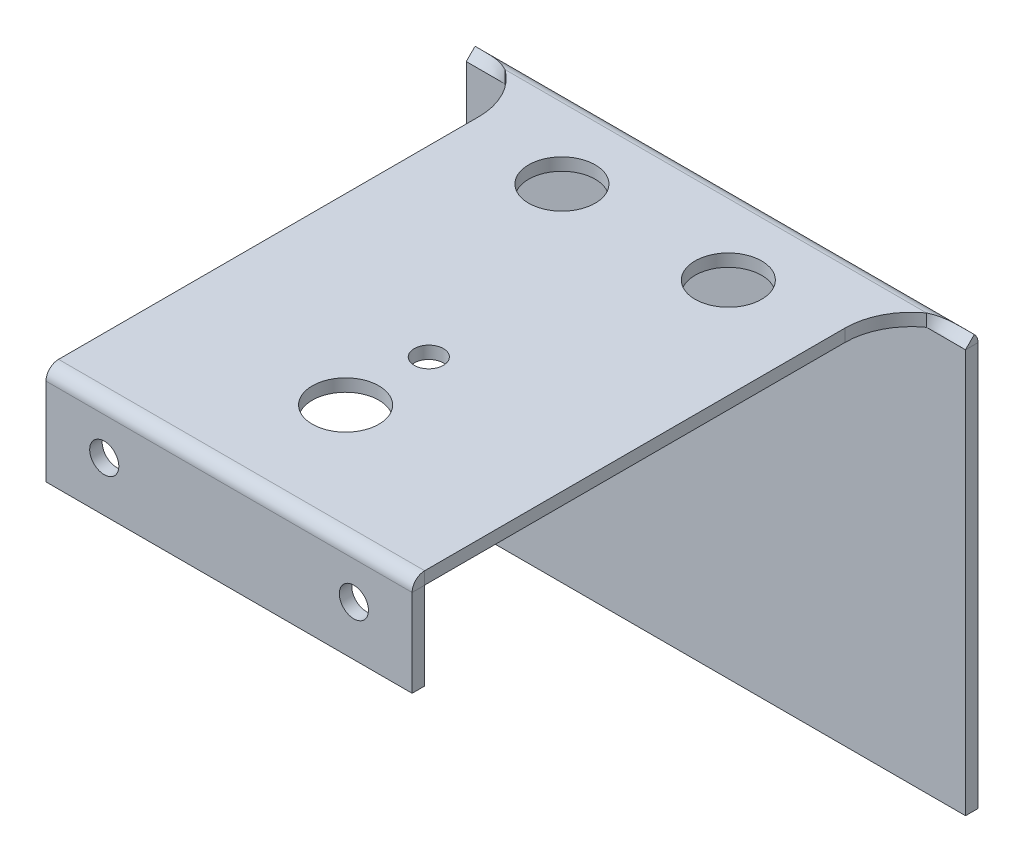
ISO-10303-21;
HEADER;
FILE_DESCRIPTION(('STEP AP214'),'2;1');
FILE_NAME('part.step','',(''),(''),'','','');
FILE_SCHEMA(('AUTOMOTIVE_DESIGN { 1 0 10303 214 1 1 1 1 }'));
ENDSEC;
DATA;
#1=APPLICATION_CONTEXT('core data for automotive mechanical design processes');
#2=APPLICATION_PROTOCOL_DEFINITION('international standard','automotive_design',2000,#1);
#3=PRODUCT_CONTEXT('',#1,'mechanical');
#4=PRODUCT('Part','Part','',(#3));
#5=PRODUCT_RELATED_PRODUCT_CATEGORY('part','',(#4));
#6=PRODUCT_DEFINITION_FORMATION('','',#4);
#7=PRODUCT_DEFINITION_CONTEXT('part definition',#1,'design');
#8=PRODUCT_DEFINITION('design','',#6,#7);
#9=PRODUCT_DEFINITION_SHAPE('','',#8);
#10=(LENGTH_UNIT() NAMED_UNIT(*) SI_UNIT(.MILLI.,.METRE.));
#11=(NAMED_UNIT(*) PLANE_ANGLE_UNIT() SI_UNIT($,.RADIAN.));
#12=(NAMED_UNIT(*) SI_UNIT($,.STERADIAN.) SOLID_ANGLE_UNIT());
#13=UNCERTAINTY_MEASURE_WITH_UNIT(LENGTH_MEASURE(1.E-05),#10,'distance_accuracy_value','');
#14=(GEOMETRIC_REPRESENTATION_CONTEXT(3) GLOBAL_UNCERTAINTY_ASSIGNED_CONTEXT((#13)) GLOBAL_UNIT_ASSIGNED_CONTEXT((#10,
#11,#12)) REPRESENTATION_CONTEXT('',''));
#15=CARTESIAN_POINT('',(0.,0.,0.));
#16=DIRECTION('',(0.,0.,1.));
#17=DIRECTION('',(1.,0.,0.));
#18=AXIS2_PLACEMENT_3D('',#15,#16,#17);
#19=CARTESIAN_POINT('',(30.,1.5,-64.));
#20=DIRECTION('',(0.,1.,0.));
#21=DIRECTION('',(0.,0.,1.));
#22=AXIS2_PLACEMENT_3D('',#19,#20,#21);
#23=PLANE('',#22);
#24=CARTESIAN_POINT('',(0.,1.5,-36.));
#25=DIRECTION('',(0.,1.,0.));
#26=DIRECTION('',(0.,0.,1.));
#27=AXIS2_PLACEMENT_3D('',#24,#25,#26);
#28=CIRCLE('',#27,1.75);
#29=CARTESIAN_POINT('',(0.,1.5,-34.25));
#30=VERTEX_POINT('',#29);
#31=EDGE_CURVE('E404',#30,#30,#28,.T.);
#32=ORIENTED_EDGE('',*,*,#31,.F.);
#33=EDGE_LOOP('',(#32));
#34=FACE_BOUND('',#33,.T.);
#35=CARTESIAN_POINT('',(-10.,1.5,-62.));
#36=DIRECTION('',(0.,1.,0.));
#37=DIRECTION('',(0.,0.,1.));
#38=AXIS2_PLACEMENT_3D('',#35,#36,#37);
#39=CIRCLE('',#38,4.);
#40=CARTESIAN_POINT('',(-10.,1.5,-58.));
#41=VERTEX_POINT('',#40);
#42=EDGE_CURVE('E416',#41,#41,#39,.T.);
#43=ORIENTED_EDGE('',*,*,#42,.F.);
#44=EDGE_LOOP('',(#43));
#45=FACE_BOUND('',#44,.T.);
#46=CARTESIAN_POINT('',(9.99999999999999,1.5,-62.));
#47=DIRECTION('',(0.,1.,0.));
#48=DIRECTION('',(0.,0.,1.));
#49=AXIS2_PLACEMENT_3D('',#46,#47,#48);
#50=CIRCLE('',#49,4.);
#51=CARTESIAN_POINT('',(9.99999999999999,1.5,-58.));
#52=VERTEX_POINT('',#51);
#53=EDGE_CURVE('E410',#52,#52,#50,.T.);
#54=ORIENTED_EDGE('',*,*,#53,.F.);
#55=EDGE_LOOP('',(#54));
#56=FACE_BOUND('',#55,.T.);
#57=CARTESIAN_POINT('',(0.,1.5,-26.));
#58=DIRECTION('',(0.,1.,0.));
#59=DIRECTION('',(0.,0.,1.));
#60=AXIS2_PLACEMENT_3D('',#57,#58,#59);
#61=CIRCLE('',#60,4.);
#62=CARTESIAN_POINT('',(0.,1.5,-22.));
#63=VERTEX_POINT('',#62);
#64=EDGE_CURVE('E397',#63,#63,#61,.T.);
#65=ORIENTED_EDGE('',*,*,#64,.F.);
#66=EDGE_LOOP('',(#65));
#67=FACE_BOUND('',#66,.T.);
#68=DIRECTION('',(0.,0.,1.));
#69=VECTOR('',#68,1.);
#70=CARTESIAN_POINT('',(-22.,1.5,0.));
#71=LINE('',#70,#69);
#72=CARTESIAN_POINT('',(-22.,1.5,-64.));
#73=VERTEX_POINT('',#72);
#74=CARTESIAN_POINT('',(-22.,1.5,-13.505));
#75=VERTEX_POINT('',#74);
#76=EDGE_CURVE('E58',#73,#75,#71,.T.);
#77=ORIENTED_EDGE('',*,*,#76,.T.);
#78=DIRECTION('',(1.,0.,0.));
#79=VECTOR('',#78,1.);
#80=CARTESIAN_POINT('',(30.,1.5,-13.505));
#81=LINE('',#80,#79);
#82=CARTESIAN_POINT('',(22.,1.49999999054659,-13.505));
#83=VERTEX_POINT('',#82);
#84=EDGE_CURVE('E499',#75,#83,#81,.T.);
#85=ORIENTED_EDGE('',*,*,#84,.T.);
#86=DIRECTION('',(0.,0.,-1.));
#87=VECTOR('',#86,1.);
#88=CARTESIAN_POINT('',(22.,1.5,0.));
#89=LINE('',#88,#87);
#90=CARTESIAN_POINT('',(22.,1.5,-64.));
#91=VERTEX_POINT('',#90);
#92=EDGE_CURVE('E424',#83,#91,#89,.T.);
#93=ORIENTED_EDGE('',*,*,#92,.T.);
#94=CARTESIAN_POINT('',(30.,1.5,-64.));
#95=DIRECTION('',(0.,-1.,0.));
#96=DIRECTION('',(0.,0.,1.));
#97=AXIS2_PLACEMENT_3D('',#94,#95,#96);
#98=CIRCLE('',#97,8.00000000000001);
#99=CARTESIAN_POINT('',(25.3293496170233,1.5,-70.495));
#100=VERTEX_POINT('',#99);
#101=EDGE_CURVE('E429',#91,#100,#98,.T.);
#102=ORIENTED_EDGE('',*,*,#101,.T.);
#103=DIRECTION('',(-1.,0.,0.));
#104=VECTOR('',#103,1.);
#105=CARTESIAN_POINT('',(30.,1.5,-70.495));
#106=LINE('',#105,#104);
#107=CARTESIAN_POINT('',(-25.3293496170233,1.50000004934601,-70.495));
#108=VERTEX_POINT('',#107);
#109=EDGE_CURVE('E426',#100,#108,#106,.T.);
#110=ORIENTED_EDGE('',*,*,#109,.T.);
#111=CARTESIAN_POINT('',(-30.,1.5,-64.));
#112=DIRECTION('',(0.,-1.,0.));
#113=DIRECTION('',(0.,0.,1.));
#114=AXIS2_PLACEMENT_3D('',#111,#112,#113);
#115=CIRCLE('',#114,8.);
#116=EDGE_CURVE('E427',#108,#73,#115,.T.);
#117=ORIENTED_EDGE('',*,*,#116,.T.);
#118=EDGE_LOOP('',(#77,#85,#93,#102,#110,#117));
#119=FACE_BOUND('',#118,.T.);
#120=ADVANCED_FACE('F54',(#34,#45,#56,#67,#119),#23,.T.);
#121=CARTESIAN_POINT('',(30.,0.,-64.));
#122=DIRECTION('',(0.,1.,0.));
#123=DIRECTION('',(0.,0.,1.));
#124=AXIS2_PLACEMENT_3D('',#121,#122,#123);
#125=PLANE('',#124);
#126=DIRECTION('',(1.,0.,0.));
#127=VECTOR('',#126,1.);
#128=CARTESIAN_POINT('',(30.,0.,-13.505));
#129=LINE('',#128,#127);
#130=CARTESIAN_POINT('',(-22.,0.,-13.505));
#131=VERTEX_POINT('',#130);
#132=CARTESIAN_POINT('',(22.,0.,-13.505));
#133=VERTEX_POINT('',#132);
#134=EDGE_CURVE('E63',#131,#133,#129,.T.);
#135=ORIENTED_EDGE('',*,*,#134,.F.);
#136=DIRECTION('',(0.,0.,1.));
#137=VECTOR('',#136,1.);
#138=CARTESIAN_POINT('',(-22.,0.,0.));
#139=LINE('',#138,#137);
#140=CARTESIAN_POINT('',(-22.,0.,-64.));
#141=VERTEX_POINT('',#140);
#142=EDGE_CURVE('E79',#141,#131,#139,.T.);
#143=ORIENTED_EDGE('',*,*,#142,.F.);
#144=CARTESIAN_POINT('',(-30.,0.,-64.));
#145=DIRECTION('',(0.,-1.,0.));
#146=DIRECTION('',(0.,0.,1.));
#147=AXIS2_PLACEMENT_3D('',#144,#145,#146);
#148=CIRCLE('',#147,8.);
#149=CARTESIAN_POINT('',(-25.3293496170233,0.,-70.495));
#150=VERTEX_POINT('',#149);
#151=EDGE_CURVE('E533',#150,#141,#148,.T.);
#152=ORIENTED_EDGE('',*,*,#151,.F.);
#153=DIRECTION('',(-1.,0.,0.));
#154=VECTOR('',#153,1.);
#155=CARTESIAN_POINT('',(30.,0.,-70.495));
#156=LINE('',#155,#154);
#157=CARTESIAN_POINT('',(25.3293496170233,0.,-70.495));
#158=VERTEX_POINT('',#157);
#159=EDGE_CURVE('E445',#158,#150,#156,.T.);
#160=ORIENTED_EDGE('',*,*,#159,.F.);
#161=CARTESIAN_POINT('',(30.,0.,-64.));
#162=DIRECTION('',(0.,-1.,0.));
#163=DIRECTION('',(0.,0.,1.));
#164=AXIS2_PLACEMENT_3D('',#161,#162,#163);
#165=CIRCLE('',#164,8.00000000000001);
#166=CARTESIAN_POINT('',(22.,0.,-64.));
#167=VERTEX_POINT('',#166);
#168=EDGE_CURVE('E419',#167,#158,#165,.T.);
#169=ORIENTED_EDGE('',*,*,#168,.F.);
#170=DIRECTION('',(0.,0.,-1.));
#171=VECTOR('',#170,1.);
#172=CARTESIAN_POINT('',(22.,0.,0.));
#173=LINE('',#172,#171);
#174=EDGE_CURVE('E71',#133,#167,#173,.T.);
#175=ORIENTED_EDGE('',*,*,#174,.F.);
#176=EDGE_LOOP('',(#135,#143,#152,#160,#169,#175));
#177=FACE_BOUND('',#176,.T.);
#178=CARTESIAN_POINT('',(0.,0.,-36.));
#179=DIRECTION('',(0.,1.,0.));
#180=DIRECTION('',(0.,0.,1.));
#181=AXIS2_PLACEMENT_3D('',#178,#179,#180);
#182=CIRCLE('',#181,1.75);
#183=CARTESIAN_POINT('',(0.,0.,-34.25));
#184=VERTEX_POINT('',#183);
#185=EDGE_CURVE('E401',#184,#184,#182,.T.);
#186=ORIENTED_EDGE('',*,*,#185,.T.);
#187=EDGE_LOOP('',(#186));
#188=FACE_BOUND('',#187,.T.);
#189=CARTESIAN_POINT('',(-10.,0.,-62.));
#190=DIRECTION('',(0.,1.,0.));
#191=DIRECTION('',(0.,0.,1.));
#192=AXIS2_PLACEMENT_3D('',#189,#190,#191);
#193=CIRCLE('',#192,4.);
#194=CARTESIAN_POINT('',(-10.,0.,-58.));
#195=VERTEX_POINT('',#194);
#196=EDGE_CURVE('E413',#195,#195,#193,.T.);
#197=ORIENTED_EDGE('',*,*,#196,.T.);
#198=EDGE_LOOP('',(#197));
#199=FACE_BOUND('',#198,.T.);
#200=CARTESIAN_POINT('',(9.99999999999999,0.,-62.));
#201=DIRECTION('',(0.,1.,0.));
#202=DIRECTION('',(0.,0.,1.));
#203=AXIS2_PLACEMENT_3D('',#200,#201,#202);
#204=CIRCLE('',#203,4.);
#205=CARTESIAN_POINT('',(9.99999999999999,0.,-58.));
#206=VERTEX_POINT('',#205);
#207=EDGE_CURVE('E407',#206,#206,#204,.T.);
#208=ORIENTED_EDGE('',*,*,#207,.T.);
#209=EDGE_LOOP('',(#208));
#210=FACE_BOUND('',#209,.T.);
#211=CARTESIAN_POINT('',(0.,0.,-26.));
#212=DIRECTION('',(0.,1.,0.));
#213=DIRECTION('',(0.,0.,1.));
#214=AXIS2_PLACEMENT_3D('',#211,#212,#213);
#215=CIRCLE('',#214,4.);
#216=CARTESIAN_POINT('',(0.,0.,-22.));
#217=VERTEX_POINT('',#216);
#218=EDGE_CURVE('E389',#217,#217,#215,.T.);
#219=ORIENTED_EDGE('',*,*,#218,.T.);
#220=EDGE_LOOP('',(#219));
#221=FACE_BOUND('',#220,.T.);
#222=ADVANCED_FACE('F463',(#177,#188,#199,#210,#221),#125,.F.);
#223=CARTESIAN_POINT('',(30.,1.5,-64.));
#224=DIRECTION('',(0.,-1.,0.));
#225=DIRECTION('',(0.,0.,-1.));
#226=AXIS2_PLACEMENT_3D('',#223,#224,#225);
#227=CYLINDRICAL_SURFACE('',#226,8.00000000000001);
#228=CARTESIAN_POINT('',(25.3293496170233,1.50000004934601,-70.495));
#229=CARTESIAN_POINT('',(25.3293496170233,4.93460099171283E-08,-70.495));
#230=B_SPLINE_CURVE_WITH_KNOTS('',1,(#228,#229),.UNSPECIFIED.,.F.,.F.,(2,2),(0.,1.),.UNSPECIFIED.);
#231=EDGE_CURVE('E434',#100,#158,#230,.T.);
#232=ORIENTED_EDGE('',*,*,#231,.F.);
#233=ORIENTED_EDGE('',*,*,#101,.F.);
#234=DIRECTION('',(0.,-1.,0.));
#235=VECTOR('',#234,1.);
#236=CARTESIAN_POINT('',(22.,1.5,-64.));
#237=LINE('',#236,#235);
#238=EDGE_CURVE('E420',#91,#167,#237,.T.);
#239=ORIENTED_EDGE('',*,*,#238,.T.);
#240=ORIENTED_EDGE('',*,*,#168,.T.);
#241=EDGE_LOOP('',(#232,#233,#239,#240));
#242=FACE_BOUND('',#241,.T.);
#243=ADVANCED_FACE('F458',(#242),#227,.F.);
#244=CARTESIAN_POINT('',(-30.,1.5,-64.));
#245=DIRECTION('',(0.,-1.,0.));
#246=DIRECTION('',(0.,0.,-1.));
#247=AXIS2_PLACEMENT_3D('',#244,#245,#246);
#248=CYLINDRICAL_SURFACE('',#247,8.);
#249=CARTESIAN_POINT('',(-25.3293496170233,4.93460099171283E-08,-70.495));
#250=CARTESIAN_POINT('',(-25.3293496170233,1.50000004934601,-70.495));
#251=B_SPLINE_CURVE_WITH_KNOTS('',1,(#249,#250),.UNSPECIFIED.,.F.,.F.,(2,2),(0.,1.),.UNSPECIFIED.);
#252=EDGE_CURVE('E440',#150,#108,#251,.T.);
#253=ORIENTED_EDGE('',*,*,#252,.F.);
#254=ORIENTED_EDGE('',*,*,#151,.T.);
#255=DIRECTION('',(0.,-1.,0.));
#256=VECTOR('',#255,1.);
#257=CARTESIAN_POINT('',(-22.,1.5,-64.));
#258=LINE('',#257,#256);
#259=EDGE_CURVE('E423',#73,#141,#258,.T.);
#260=ORIENTED_EDGE('',*,*,#259,.F.);
#261=ORIENTED_EDGE('',*,*,#116,.F.);
#262=EDGE_LOOP('',(#253,#254,#260,#261));
#263=FACE_BOUND('',#262,.T.);
#264=ADVANCED_FACE('F447',(#263),#248,.F.);
#265=CARTESIAN_POINT('',(-22.,1.5,0.));
#266=DIRECTION('',(1.,0.,0.));
#267=DIRECTION('',(0.,0.,-1.));
#268=AXIS2_PLACEMENT_3D('',#265,#266,#267);
#269=PLANE('',#268);
#270=DIRECTION('',(0.,-1.,0.));
#271=VECTOR('',#270,1.);
#272=CARTESIAN_POINT('',(-22.,1.5,-13.505));
#273=LINE('',#272,#271);
#274=EDGE_CURVE('E501',#75,#131,#273,.T.);
#275=ORIENTED_EDGE('',*,*,#274,.F.);
#276=ORIENTED_EDGE('',*,*,#76,.F.);
#277=ORIENTED_EDGE('',*,*,#259,.T.);
#278=ORIENTED_EDGE('',*,*,#142,.T.);
#279=EDGE_LOOP('',(#275,#276,#277,#278));
#280=FACE_BOUND('',#279,.T.);
#281=ADVANCED_FACE('F457',(#280),#269,.F.);
#282=CARTESIAN_POINT('',(22.,1.5,0.));
#283=DIRECTION('',(-1.,0.,0.));
#284=DIRECTION('',(0.,0.,1.));
#285=AXIS2_PLACEMENT_3D('',#282,#283,#284);
#286=PLANE('',#285);
#287=DIRECTION('',(0.,1.,0.));
#288=VECTOR('',#287,1.);
#289=CARTESIAN_POINT('',(22.,1.5,-13.505));
#290=LINE('',#289,#288);
#291=EDGE_CURVE('E12',#133,#83,#290,.T.);
#292=ORIENTED_EDGE('',*,*,#291,.F.);
#293=ORIENTED_EDGE('',*,*,#174,.T.);
#294=ORIENTED_EDGE('',*,*,#238,.F.);
#295=ORIENTED_EDGE('',*,*,#92,.F.);
#296=EDGE_LOOP('',(#292,#293,#294,#295));
#297=FACE_BOUND('',#296,.T.);
#298=ADVANCED_FACE('F56',(#297),#286,.F.);
#299=CARTESIAN_POINT('',(-10.,1.5,-62.));
#300=DIRECTION('',(0.,-1.,0.));
#301=DIRECTION('',(0.,0.,-1.));
#302=AXIS2_PLACEMENT_3D('',#299,#300,#301);
#303=CYLINDRICAL_SURFACE('',#302,4.);
#304=ORIENTED_EDGE('',*,*,#42,.T.);
#305=EDGE_LOOP('',(#304));
#306=FACE_BOUND('',#305,.T.);
#307=ORIENTED_EDGE('',*,*,#196,.F.);
#308=EDGE_LOOP('',(#307));
#309=FACE_BOUND('',#308,.T.);
#310=ADVANCED_FACE('F842',(#306,#309),#303,.F.);
#311=CARTESIAN_POINT('',(9.99999999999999,1.5,-62.));
#312=DIRECTION('',(0.,-1.,0.));
#313=DIRECTION('',(0.,0.,-1.));
#314=AXIS2_PLACEMENT_3D('',#311,#312,#313);
#315=CYLINDRICAL_SURFACE('',#314,4.);
#316=ORIENTED_EDGE('',*,*,#53,.T.);
#317=EDGE_LOOP('',(#316));
#318=FACE_BOUND('',#317,.T.);
#319=ORIENTED_EDGE('',*,*,#207,.F.);
#320=EDGE_LOOP('',(#319));
#321=FACE_BOUND('',#320,.T.);
#322=ADVANCED_FACE('F491',(#318,#321),#315,.F.);
#323=CARTESIAN_POINT('',(0.,1.5,-36.));
#324=DIRECTION('',(0.,-1.,0.));
#325=DIRECTION('',(0.,0.,-1.));
#326=AXIS2_PLACEMENT_3D('',#323,#324,#325);
#327=CYLINDRICAL_SURFACE('',#326,1.75);
#328=ORIENTED_EDGE('',*,*,#31,.T.);
#329=EDGE_LOOP('',(#328));
#330=FACE_BOUND('',#329,.T.);
#331=ORIENTED_EDGE('',*,*,#185,.F.);
#332=EDGE_LOOP('',(#331));
#333=FACE_BOUND('',#332,.T.);
#334=ADVANCED_FACE('F483',(#330,#333),#327,.F.);
#335=CARTESIAN_POINT('',(0.,1.5,-26.));
#336=DIRECTION('',(0.,-1.,0.));
#337=DIRECTION('',(0.,0.,-1.));
#338=AXIS2_PLACEMENT_3D('',#335,#336,#337);
#339=CYLINDRICAL_SURFACE('',#338,4.);
#340=ORIENTED_EDGE('',*,*,#64,.T.);
#341=EDGE_LOOP('',(#340));
#342=FACE_BOUND('',#341,.T.);
#343=ORIENTED_EDGE('',*,*,#218,.F.);
#344=EDGE_LOOP('',(#343));
#345=FACE_BOUND('',#344,.T.);
#346=ADVANCED_FACE('F349',(#342,#345),#339,.F.);
#347=CARTESIAN_POINT('',(25.3293496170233,1.50000004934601,-70.495));
#348=CARTESIAN_POINT('',(25.8063753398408,1.50000004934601,-70.7248903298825));
#349=CARTESIAN_POINT('',(26.2324936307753,1.44912501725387,-70.9113821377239));
#350=CARTESIAN_POINT('',(26.7970237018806,1.36671215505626,-71.1197749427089));
#351=CARTESIAN_POINT('',(26.9726639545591,1.33790001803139,-71.1778244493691));
#352=CARTESIAN_POINT('',(27.2173196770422,1.29825619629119,-71.2495275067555));
#353=CARTESIAN_POINT('',(27.295737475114,1.2856143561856,-71.2708740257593));
#354=CARTESIAN_POINT('',(27.4086630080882,1.26801372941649,-71.2993042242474));
#355=CARTESIAN_POINT('',(27.4455213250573,1.26237258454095,-71.3081826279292));
#356=CARTESIAN_POINT('',(27.4996335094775,1.25430114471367,-71.320631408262));
#357=CARTESIAN_POINT('',(27.5174750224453,1.25167563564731,-71.324636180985));
#358=CARTESIAN_POINT('',(27.5439434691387,1.24784062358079,-71.3304295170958));
#359=CARTESIAN_POINT('',(27.5527173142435,1.24657949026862,-71.3323249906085));
#360=CARTESIAN_POINT('',(27.5701670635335,1.24409254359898,-71.3360452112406));
#361=CARTESIAN_POINT('',(27.5779055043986,1.24299796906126,-71.3376754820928));
#362=CARTESIAN_POINT('',(28.1995913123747,1.15596595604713,-71.4666438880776));
#363=CARTESIAN_POINT('',(29.0037871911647,1.08590796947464,-71.5345545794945));
#364=CARTESIAN_POINT('',(30.,1.05773127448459,-71.5627312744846));
#365=CARTESIAN_POINT('',(25.3293496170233,4.93460099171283E-08,-70.495));
#366=CARTESIAN_POINT('',(25.8059945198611,4.93460099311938E-08,-70.4965212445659));
#367=CARTESIAN_POINT('',(26.2324936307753,-0.000336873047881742,-70.4977575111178));
#368=CARTESIAN_POINT('',(26.7970237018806,-0.000882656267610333,-70.4991376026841));
#369=CARTESIAN_POINT('',(26.9726639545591,-0.00107346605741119,-70.4995220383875));
#370=CARTESIAN_POINT('',(27.2173196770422,-0.00133600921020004,-70.4999968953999));
#371=CARTESIAN_POINT('',(27.295737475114,-0.00141973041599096,-70.5001382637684));
#372=CARTESIAN_POINT('',(27.4086630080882,-0.0015362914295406,-70.5003265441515));
#373=CARTESIAN_POINT('',(27.4455213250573,-0.00157365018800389,-70.5003853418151));
#374=CARTESIAN_POINT('',(27.4996335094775,-0.00162710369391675,-70.5004677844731));
#375=CARTESIAN_POINT('',(27.5174750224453,-0.00164449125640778,-70.5004943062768));
#376=CARTESIAN_POINT('',(27.5439434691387,-0.00166988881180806,-70.5005326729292));
#377=CARTESIAN_POINT('',(27.5527173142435,-0.00167824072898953,-70.5005452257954));
#378=CARTESIAN_POINT('',(27.5701670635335,-0.00169471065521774,-70.5005698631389));
#379=CARTESIAN_POINT('',(27.5779055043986,-0.00170195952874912,-70.5005806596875));
#380=CARTESIAN_POINT('',(28.1995913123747,-0.00227833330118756,-70.5014347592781));
#381=CARTESIAN_POINT('',(29.0037680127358,-0.00274229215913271,-70.5018844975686));
#382=CARTESIAN_POINT('',(30.,-0.00292889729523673,-70.5020711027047));
#383=B_SPLINE_SURFACE_WITH_KNOTS('',1,3,((#347,#348,#349,#350,#351,#352,#353,#354,#355,#356,
#357,#358,#359,#360,#361,#362,#363,#364),(#365,#366,#367,#368,#369,#370,#371,#372,#373,#374,
#375,#376,#377,#378,#379,#380,#381,#382)),.UNSPECIFIED.,.F.,.F.,.F.,(2,2),(4,2,2,2,2,2,2,2,4),
(0.,1.),(0.,0.25,0.375,0.4375,0.46875,0.484375,0.4921875,0.5,1.),.UNSPECIFIED.);
#384=CARTESIAN_POINT('',(25.3293496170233,4.93460099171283E-08,-70.495));
#385=CARTESIAN_POINT('',(25.8059945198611,4.93460099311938E-08,-70.4965212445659));
#386=CARTESIAN_POINT('',(26.2324936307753,-0.000336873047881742,-70.4977575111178));
#387=CARTESIAN_POINT('',(26.7970237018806,-0.000882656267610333,-70.4991376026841));
#388=CARTESIAN_POINT('',(26.9726639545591,-0.00107346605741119,-70.4995220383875));
#389=CARTESIAN_POINT('',(27.2173196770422,-0.00133600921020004,-70.4999968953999));
#390=CARTESIAN_POINT('',(27.295737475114,-0.00141973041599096,-70.5001382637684));
#391=CARTESIAN_POINT('',(27.4086630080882,-0.0015362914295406,-70.5003265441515));
#392=CARTESIAN_POINT('',(27.4455213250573,-0.00157365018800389,-70.5003853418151));
#393=CARTESIAN_POINT('',(27.4996335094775,-0.00162710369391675,-70.5004677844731));
#394=CARTESIAN_POINT('',(27.5174750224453,-0.00164449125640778,-70.5004943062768));
#395=CARTESIAN_POINT('',(27.5439434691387,-0.00166988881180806,-70.5005326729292));
#396=CARTESIAN_POINT('',(27.5527173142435,-0.00167824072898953,-70.5005452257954));
#397=CARTESIAN_POINT('',(27.5701670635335,-0.00169471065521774,-70.5005698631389));
#398=CARTESIAN_POINT('',(27.5779055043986,-0.00170195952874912,-70.5005806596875));
#399=CARTESIAN_POINT('',(28.1995913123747,-0.00227833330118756,-70.5014347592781));
#400=CARTESIAN_POINT('',(29.0037680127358,-0.00274229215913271,-70.5018844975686));
#401=CARTESIAN_POINT('',(30.,-0.00292889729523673,-70.5020711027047));
#402=B_SPLINE_CURVE_WITH_KNOTS('',3,(#384,#385,#386,#387,#388,#389,#390,#391,#392,#393,#394,
#395,#396,#397,#398,#399,#400,#401),.UNSPECIFIED.,.F.,.F.,(4,2,2,2,2,2,2,2,4),(0.,0.25,0.375,
0.4375,0.46875,0.484375,0.4921875,0.5,1.),.UNSPECIFIED.);
#403=CARTESIAN_POINT('',(30.,-0.00292889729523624,-70.5020711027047));
#404=VERTEX_POINT('',#403);
#405=EDGE_CURVE('E225',#158,#404,#402,.T.);
#406=CARTESIAN_POINT('',(30.,-0.00292889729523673,-70.5020711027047));
#407=CARTESIAN_POINT('',(30.,1.05773127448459,-71.5627312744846));
#408=B_SPLINE_CURVE_WITH_KNOTS('',1,(#406,#407),.UNSPECIFIED.,.F.,.F.,(2,2),(0.,1.),.UNSPECIFIED.);
#409=CARTESIAN_POINT('',(30.,1.05773127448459,-71.5627312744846));
#410=VERTEX_POINT('',#409);
#411=EDGE_CURVE('E398',#404,#410,#408,.T.);
#412=CARTESIAN_POINT('',(30.,1.05773127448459,-71.5627312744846));
#413=CARTESIAN_POINT('',(29.0037871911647,1.08590796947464,-71.5345545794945));
#414=CARTESIAN_POINT('',(28.1995913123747,1.15596595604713,-71.4666438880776));
#415=CARTESIAN_POINT('',(27.5779055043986,1.24299796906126,-71.3376754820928));
#416=CARTESIAN_POINT('',(27.5701670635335,1.24409254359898,-71.3360452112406));
#417=CARTESIAN_POINT('',(27.5527173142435,1.24657949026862,-71.3323249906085));
#418=CARTESIAN_POINT('',(27.5439434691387,1.24784062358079,-71.3304295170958));
#419=CARTESIAN_POINT('',(27.5174750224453,1.25167563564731,-71.324636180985));
#420=CARTESIAN_POINT('',(27.4996335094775,1.25430114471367,-71.320631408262));
#421=CARTESIAN_POINT('',(27.4455213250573,1.26237258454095,-71.3081826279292));
#422=CARTESIAN_POINT('',(27.4086630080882,1.26801372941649,-71.2993042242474));
#423=CARTESIAN_POINT('',(27.295737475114,1.2856143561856,-71.2708740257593));
#424=CARTESIAN_POINT('',(27.2173196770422,1.29825619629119,-71.2495275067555));
#425=CARTESIAN_POINT('',(26.9726639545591,1.33790001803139,-71.1778244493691));
#426=CARTESIAN_POINT('',(26.7970237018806,1.36671215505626,-71.1197749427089));
#427=CARTESIAN_POINT('',(26.2324936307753,1.44912501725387,-70.9113821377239));
#428=CARTESIAN_POINT('',(25.8063753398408,1.50000004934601,-70.7248903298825));
#429=CARTESIAN_POINT('',(25.3293496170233,1.50000004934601,-70.495));
#430=B_SPLINE_CURVE_WITH_KNOTS('',3,(#412,#413,#414,#415,#416,#417,#418,#419,#420,#421,#422,
#423,#424,#425,#426,#427,#428,#429),.UNSPECIFIED.,.F.,.F.,(4,2,2,2,2,2,2,2,4),(0.,0.5,0.5078125,
0.515625,0.53125,0.5625,0.625,0.75,1.),.UNSPECIFIED.);
#431=EDGE_CURVE('E562',#100,#410,#430,.F.);
#432=ORIENTED_EDGE('',*,*,#231,.T.);
#433=ORIENTED_EDGE('',*,*,#405,.T.);
#434=ORIENTED_EDGE('',*,*,#411,.T.);
#435=ORIENTED_EDGE('',*,*,#431,.F.);
#436=EDGE_LOOP('',(#432,#433,#434,#435));
#437=FACE_BOUND('',#436,.T.);
#438=ADVANCED_FACE('F345',(#437),#383,.T.);
#439=CARTESIAN_POINT('',(30.,-0.0100000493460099,-70.495));
#440=DIRECTION('',(1.,0.,0.));
#441=DIRECTION('',(0.,0.,-1.));
#442=AXIS2_PLACEMENT_3D('',#439,#440,#441);
#443=PLANE('',#442);
#444=ORIENTED_EDGE('',*,*,#411,.F.);
#445=CARTESIAN_POINT('',(30.,-0.01,-70.495));
#446=DIRECTION('',(-1.,0.,0.));
#447=DIRECTION('',(0.,0.,1.));
#448=AXIS2_PLACEMENT_3D('',#445,#446,#447);
#449=CIRCLE('',#448,0.0100000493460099);
#450=CARTESIAN_POINT('',(30.,-0.01000000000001,-70.505));
#451=VERTEX_POINT('',#450);
#452=EDGE_CURVE('E252',#404,#451,#449,.T.);
#453=ORIENTED_EDGE('',*,*,#452,.T.);
#454=DIRECTION('',(0.,0.,1.));
#455=VECTOR('',#454,1.);
#456=CARTESIAN_POINT('',(30.,-0.01000000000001,-72.005));
#457=LINE('',#456,#455);
#458=CARTESIAN_POINT('',(30.,-0.01000000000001,-72.005));
#459=VERTEX_POINT('',#458);
#460=EDGE_CURVE('E235',#459,#451,#457,.T.);
#461=ORIENTED_EDGE('',*,*,#460,.F.);
#462=CARTESIAN_POINT('',(30.,-0.0100000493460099,-70.495));
#463=DIRECTION('',(-1.,0.,0.));
#464=DIRECTION('',(0.,0.,1.));
#465=AXIS2_PLACEMENT_3D('',#462,#463,#464);
#466=CIRCLE('',#465,1.51000006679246);
#467=EDGE_CURVE('E262',#410,#459,#466,.T.);
#468=ORIENTED_EDGE('',*,*,#467,.F.);
#469=EDGE_LOOP('',(#444,#453,#461,#468));
#470=FACE_BOUND('',#469,.T.);
#471=ADVANCED_FACE('F489',(#470),#443,.T.);
#472=CARTESIAN_POINT('',(-30.,-0.0100000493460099,-70.495));
#473=DIRECTION('',(-1.,0.,0.));
#474=DIRECTION('',(0.,0.,1.));
#475=AXIS2_PLACEMENT_3D('',#472,#473,#474);
#476=PLANE('',#475);
#477=DIRECTION('',(0.,0.,-1.));
#478=VECTOR('',#477,1.);
#479=CARTESIAN_POINT('',(-30.,-0.01000000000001,-72.005));
#480=LINE('',#479,#478);
#481=CARTESIAN_POINT('',(-30.,-0.01000000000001,-70.505));
#482=VERTEX_POINT('',#481);
#483=CARTESIAN_POINT('',(-30.,-0.010000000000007,-72.005000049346));
#484=VERTEX_POINT('',#483);
#485=EDGE_CURVE('E226',#482,#484,#480,.T.);
#486=ORIENTED_EDGE('',*,*,#485,.F.);
#487=CARTESIAN_POINT('',(-30.,-0.01,-70.495));
#488=DIRECTION('',(-1.,0.,0.));
#489=DIRECTION('',(0.,0.,1.));
#490=AXIS2_PLACEMENT_3D('',#487,#488,#489);
#491=CIRCLE('',#490,0.0100000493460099);
#492=CARTESIAN_POINT('',(-30.,-0.0029288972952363,-70.5020711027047));
#493=VERTEX_POINT('',#492);
#494=EDGE_CURVE('E255',#482,#493,#491,.F.);
#495=ORIENTED_EDGE('',*,*,#494,.T.);
#496=CARTESIAN_POINT('',(-30.,1.05773127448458,-71.5627312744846));
#497=CARTESIAN_POINT('',(-30.,-0.00292889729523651,-70.5020711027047));
#498=B_SPLINE_CURVE_WITH_KNOTS('',1,(#496,#497),.UNSPECIFIED.,.F.,.F.,(2,2),(0.,1.),.UNSPECIFIED.);
#499=CARTESIAN_POINT('',(-30.,1.05773126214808,-71.5627312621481));
#500=VERTEX_POINT('',#499);
#501=EDGE_CURVE('E377',#493,#500,#498,.F.);
#502=ORIENTED_EDGE('',*,*,#501,.T.);
#503=CARTESIAN_POINT('',(-30.,-0.0100000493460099,-70.495));
#504=DIRECTION('',(1.,0.,0.));
#505=DIRECTION('',(0.,0.,-1.));
#506=AXIS2_PLACEMENT_3D('',#503,#504,#505);
#507=CIRCLE('',#506,1.51000006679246);
#508=EDGE_CURVE('E304',#484,#500,#507,.T.);
#509=ORIENTED_EDGE('',*,*,#508,.F.);
#510=EDGE_LOOP('',(#486,#495,#502,#509));
#511=FACE_BOUND('',#510,.T.);
#512=ADVANCED_FACE('F278',(#511),#476,.T.);
#513=CARTESIAN_POINT('',(-30.,1.05773127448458,-71.5627312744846));
#514=CARTESIAN_POINT('',(-29.4814024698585,1.07597145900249,-71.5444910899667));
#515=CARTESIAN_POINT('',(-29.0210072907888,1.10181593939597,-71.5178879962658));
#516=CARTESIAN_POINT('',(-28.4177209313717,1.14915408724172,-71.4630111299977));
#517=CARTESIAN_POINT('',(-28.2311763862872,1.16634160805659,-71.4422105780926));
#518=CARTESIAN_POINT('',(-27.9731859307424,1.19367270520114,-71.4068629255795));
#519=CARTESIAN_POINT('',(-27.8908268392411,1.20303979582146,-71.3943888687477));
#520=CARTESIAN_POINT('',(-27.7727447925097,1.21739023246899,-71.3745907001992));
#521=CARTESIAN_POINT('',(-27.7342935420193,1.22222356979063,-71.367810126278));
#522=CARTESIAN_POINT('',(-27.6779808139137,1.22953670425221,-71.3573612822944));
#523=CARTESIAN_POINT('',(-27.6594372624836,1.23198493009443,-71.3538320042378));
#524=CARTESIAN_POINT('',(-27.6228048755,1.23690038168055,-71.3466797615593));
#525=CARTESIAN_POINT('',(-27.6061303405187,1.23917157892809,-71.3433474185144));
#526=CARTESIAN_POINT('',(-27.2784421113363,1.28459066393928,-71.276011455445));
#527=CARTESIAN_POINT('',(-26.9361104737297,1.34440936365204,-71.1790897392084));
#528=CARTESIAN_POINT('',(-26.1836088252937,1.45217488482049,-70.9005220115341));
#529=CARTESIAN_POINT('',(-25.7737820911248,1.50000004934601,-70.7174135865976));
#530=CARTESIAN_POINT('',(-25.3293496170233,1.50000004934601,-70.495));
#531=CARTESIAN_POINT('',(-30.,-0.00292889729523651,-70.5020711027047));
#532=CARTESIAN_POINT('',(-29.4814018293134,-0.00280810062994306,-70.5019503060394));
#533=CARTESIAN_POINT('',(-29.0210072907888,-0.0026369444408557,-70.5017741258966));
#534=CARTESIAN_POINT('',(-28.4177209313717,-0.00232344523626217,-70.5014107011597));
#535=CARTESIAN_POINT('',(-28.2311763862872,-0.00220962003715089,-70.501272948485));
#536=CARTESIAN_POINT('',(-27.9731859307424,-0.00202861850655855,-70.5010388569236));
#537=CARTESIAN_POINT('',(-27.8908268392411,-0.00196658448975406,-70.5009562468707));
#538=CARTESIAN_POINT('',(-27.7727447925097,-0.00187154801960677,-70.500825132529));
#539=CARTESIAN_POINT('',(-27.7342935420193,-0.0018395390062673,-70.5007802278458));
#540=CARTESIAN_POINT('',(-27.6779808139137,-0.00179110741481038,-70.5007110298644));
#541=CARTESIAN_POINT('',(-27.6594372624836,-0.00177489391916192,-70.5006876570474));
#542=CARTESIAN_POINT('',(-27.6228048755,-0.00174234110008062,-70.5006402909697));
#543=CARTESIAN_POINT('',(-27.6061303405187,-0.00172729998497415,-70.5006182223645));
#544=CARTESIAN_POINT('',(-27.2784421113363,-0.00142650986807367,-70.5001722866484));
#545=CARTESIAN_POINT('',(-26.9361104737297,-0.00103035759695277,-70.4995304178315));
#546=CARTESIAN_POINT('',(-26.1836088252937,-0.000316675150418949,-70.4976855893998));
#547=CARTESIAN_POINT('',(-25.7734388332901,4.93460099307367E-08,-70.4964718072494));
#548=CARTESIAN_POINT('',(-25.3293496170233,4.93460099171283E-08,-70.495));
#549=B_SPLINE_SURFACE_WITH_KNOTS('',1,3,((#513,#514,#515,#516,#517,#518,#519,#520,#521,#522,
#523,#524,#525,#526,#527,#528,#529,#530),(#531,#532,#533,#534,#535,#536,#537,#538,#539,#540,
#541,#542,#543,#544,#545,#546,#547,#548)),.UNSPECIFIED.,.F.,.F.,.F.,(2,2),(4,2,2,2,2,2,2,2,4),
(0.,1.),(0.,0.25,0.375,0.4375,0.46875,0.484375,0.5,0.75,1.),.UNSPECIFIED.);
#550=CARTESIAN_POINT('',(-30.,-0.00292889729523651,-70.5020711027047));
#551=CARTESIAN_POINT('',(-29.4814018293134,-0.00280810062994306,-70.5019503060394));
#552=CARTESIAN_POINT('',(-29.0210072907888,-0.0026369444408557,-70.5017741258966));
#553=CARTESIAN_POINT('',(-28.4177209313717,-0.00232344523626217,-70.5014107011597));
#554=CARTESIAN_POINT('',(-28.2311763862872,-0.00220962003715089,-70.501272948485));
#555=CARTESIAN_POINT('',(-27.9731859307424,-0.00202861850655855,-70.5010388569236));
#556=CARTESIAN_POINT('',(-27.8908268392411,-0.00196658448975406,-70.5009562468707));
#557=CARTESIAN_POINT('',(-27.7727447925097,-0.00187154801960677,-70.500825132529));
#558=CARTESIAN_POINT('',(-27.7342935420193,-0.0018395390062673,-70.5007802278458));
#559=CARTESIAN_POINT('',(-27.6779808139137,-0.00179110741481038,-70.5007110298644));
#560=CARTESIAN_POINT('',(-27.6594372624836,-0.00177489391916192,-70.5006876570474));
#561=CARTESIAN_POINT('',(-27.6228048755,-0.00174234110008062,-70.5006402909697));
#562=CARTESIAN_POINT('',(-27.6061303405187,-0.00172729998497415,-70.5006182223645));
#563=CARTESIAN_POINT('',(-27.2784421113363,-0.00142650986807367,-70.5001722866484));
#564=CARTESIAN_POINT('',(-26.9361104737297,-0.00103035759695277,-70.4995304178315));
#565=CARTESIAN_POINT('',(-26.1836088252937,-0.000316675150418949,-70.4976855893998));
#566=CARTESIAN_POINT('',(-25.7734388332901,4.93460099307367E-08,-70.4964718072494));
#567=CARTESIAN_POINT('',(-25.3293496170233,4.93460099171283E-08,-70.495));
#568=B_SPLINE_CURVE_WITH_KNOTS('',3,(#550,#551,#552,#553,#554,#555,#556,#557,#558,#559,#560,
#561,#562,#563,#564,#565,#566,#567),.UNSPECIFIED.,.F.,.F.,(4,2,2,2,2,2,2,2,4),(0.,0.25,0.375,
0.4375,0.46875,0.484375,0.5,0.75,1.),.UNSPECIFIED.);
#569=EDGE_CURVE('E314',#493,#150,#568,.T.);
#570=CARTESIAN_POINT('',(-25.3293496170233,1.50000004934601,-70.495));
#571=CARTESIAN_POINT('',(-25.7737820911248,1.50000004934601,-70.7174135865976));
#572=CARTESIAN_POINT('',(-26.1836088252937,1.45217488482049,-70.9005220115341));
#573=CARTESIAN_POINT('',(-26.9361104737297,1.34440936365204,-71.1790897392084));
#574=CARTESIAN_POINT('',(-27.2784421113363,1.28459066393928,-71.276011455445));
#575=CARTESIAN_POINT('',(-27.6061303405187,1.23917157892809,-71.3433474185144));
#576=CARTESIAN_POINT('',(-27.6228048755,1.23690038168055,-71.3466797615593));
#577=CARTESIAN_POINT('',(-27.6594372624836,1.23198493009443,-71.3538320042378));
#578=CARTESIAN_POINT('',(-27.6779808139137,1.22953670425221,-71.3573612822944));
#579=CARTESIAN_POINT('',(-27.7342935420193,1.22222356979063,-71.367810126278));
#580=CARTESIAN_POINT('',(-27.7727447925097,1.21739023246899,-71.3745907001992));
#581=CARTESIAN_POINT('',(-27.8908268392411,1.20303979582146,-71.3943888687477));
#582=CARTESIAN_POINT('',(-27.9731859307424,1.19367270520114,-71.4068629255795));
#583=CARTESIAN_POINT('',(-28.2311763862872,1.16634160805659,-71.4422105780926));
#584=CARTESIAN_POINT('',(-28.4177209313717,1.14915408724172,-71.4630111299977));
#585=CARTESIAN_POINT('',(-29.0210072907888,1.10181593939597,-71.5178879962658));
#586=CARTESIAN_POINT('',(-29.4814024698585,1.07597145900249,-71.5444910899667));
#587=CARTESIAN_POINT('',(-30.,1.05773127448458,-71.5627312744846));
#588=B_SPLINE_CURVE_WITH_KNOTS('',3,(#570,#571,#572,#573,#574,#575,#576,#577,#578,#579,#580,
#581,#582,#583,#584,#585,#586,#587),.UNSPECIFIED.,.F.,.F.,(4,2,2,2,2,2,2,2,4),(0.,0.25,0.5,
0.515625,0.53125,0.5625,0.625,0.75,1.),.UNSPECIFIED.);
#589=EDGE_CURVE('E303',#500,#108,#588,.F.);
#590=ORIENTED_EDGE('',*,*,#569,.T.);
#591=ORIENTED_EDGE('',*,*,#252,.T.);
#592=ORIENTED_EDGE('',*,*,#589,.F.);
#593=ORIENTED_EDGE('',*,*,#501,.F.);
#594=EDGE_LOOP('',(#590,#591,#592,#593));
#595=FACE_BOUND('',#594,.T.);
#596=ADVANCED_FACE('F276',(#595),#549,.T.);
#597=CARTESIAN_POINT('',(60.0941769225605,-0.01,-70.495));
#598=DIRECTION('',(-1.,0.,0.));
#599=DIRECTION('',(0.,0.,1.));
#600=AXIS2_PLACEMENT_3D('',#597,#598,#599);
#601=CYLINDRICAL_SURFACE('',#600,1.51000004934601);
#602=ORIENTED_EDGE('',*,*,#508,.T.);
#603=ORIENTED_EDGE('',*,*,#589,.T.);
#604=ORIENTED_EDGE('',*,*,#109,.F.);
#605=ORIENTED_EDGE('',*,*,#431,.T.);
#606=ORIENTED_EDGE('',*,*,#467,.T.);
#607=DIRECTION('',(-1.,0.,0.));
#608=VECTOR('',#607,1.);
#609=CARTESIAN_POINT('',(30.,-0.01000000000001,-72.005));
#610=LINE('',#609,#608);
#611=EDGE_CURVE('E221',#459,#484,#610,.T.);
#612=ORIENTED_EDGE('',*,*,#611,.T.);
#613=EDGE_LOOP('',(#602,#603,#604,#605,#606,#612));
#614=FACE_BOUND('',#613,.T.);
#615=ADVANCED_FACE('F265',(#614),#601,.T.);
#616=CARTESIAN_POINT('',(60.0941769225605,-0.01,-70.495));
#617=DIRECTION('',(-1.,0.,0.));
#618=DIRECTION('',(0.,0.,1.));
#619=AXIS2_PLACEMENT_3D('',#616,#617,#618);
#620=CYLINDRICAL_SURFACE('',#619,0.0100000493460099);
#621=ORIENTED_EDGE('',*,*,#494,.F.);
#622=DIRECTION('',(-1.,0.,0.));
#623=VECTOR('',#622,1.);
#624=CARTESIAN_POINT('',(30.,-0.01000000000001,-70.505));
#625=LINE('',#624,#623);
#626=EDGE_CURVE('E230',#451,#482,#625,.T.);
#627=ORIENTED_EDGE('',*,*,#626,.F.);
#628=ORIENTED_EDGE('',*,*,#452,.F.);
#629=ORIENTED_EDGE('',*,*,#405,.F.);
#630=ORIENTED_EDGE('',*,*,#159,.T.);
#631=ORIENTED_EDGE('',*,*,#569,.F.);
#632=EDGE_LOOP('',(#621,#627,#628,#629,#630,#631));
#633=FACE_BOUND('',#632,.T.);
#634=ADVANCED_FACE('F275',(#633),#620,.F.);
#635=CARTESIAN_POINT('',(-30.,-48.505,-72.0049999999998));
#636=DIRECTION('',(0.,1.,0.));
#637=DIRECTION('',(1.,0.,0.));
#638=AXIS2_PLACEMENT_3D('',#635,#636,#637);
#639=PLANE('',#638);
#640=DIRECTION('',(-1.,0.,0.));
#641=VECTOR('',#640,1.);
#642=CARTESIAN_POINT('',(-30.,-48.505,-70.5049999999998));
#643=LINE('',#642,#641);
#644=CARTESIAN_POINT('',(30.,-48.505,-70.5049999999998));
#645=VERTEX_POINT('',#644);
#646=CARTESIAN_POINT('',(-30.,-48.505,-70.5049999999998));
#647=VERTEX_POINT('',#646);
#648=EDGE_CURVE('E248',#645,#647,#643,.T.);
#649=ORIENTED_EDGE('',*,*,#648,.T.);
#650=DIRECTION('',(0.,0.,1.));
#651=VECTOR('',#650,1.);
#652=CARTESIAN_POINT('',(-30.,-48.505,-72.0049999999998));
#653=LINE('',#652,#651);
#654=CARTESIAN_POINT('',(-30.,-48.505,-72.0049999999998));
#655=VERTEX_POINT('',#654);
#656=EDGE_CURVE('E222',#655,#647,#653,.T.);
#657=ORIENTED_EDGE('',*,*,#656,.F.);
#658=DIRECTION('',(-1.,0.,0.));
#659=VECTOR('',#658,1.);
#660=CARTESIAN_POINT('',(-30.,-48.505,-72.0049999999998));
#661=LINE('',#660,#659);
#662=CARTESIAN_POINT('',(30.,-48.505,-72.0049999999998));
#663=VERTEX_POINT('',#662);
#664=EDGE_CURVE('E241',#663,#655,#661,.T.);
#665=ORIENTED_EDGE('',*,*,#664,.F.);
#666=DIRECTION('',(0.,0.,1.));
#667=VECTOR('',#666,1.);
#668=CARTESIAN_POINT('',(30.,-48.505,-72.0049999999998));
#669=LINE('',#668,#667);
#670=EDGE_CURVE('E245',#663,#645,#669,.T.);
#671=ORIENTED_EDGE('',*,*,#670,.T.);
#672=EDGE_LOOP('',(#649,#657,#665,#671));
#673=FACE_BOUND('',#672,.T.);
#674=ADVANCED_FACE('F608',(#673),#639,.F.);
#675=CARTESIAN_POINT('',(30.,9.49500000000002,-72.005));
#676=DIRECTION('',(0.,0.,-1.));
#677=DIRECTION('',(0.,1.,0.));
#678=AXIS2_PLACEMENT_3D('',#675,#676,#677);
#679=PLANE('',#678);
#680=ORIENTED_EDGE('',*,*,#611,.F.);
#681=DIRECTION('',(0.,-1.,0.));
#682=VECTOR('',#681,1.);
#683=CARTESIAN_POINT('',(30.,1.495,-72.005));
#684=LINE('',#683,#682);
#685=EDGE_CURVE('E243',#459,#663,#684,.T.);
#686=ORIENTED_EDGE('',*,*,#685,.T.);
#687=ORIENTED_EDGE('',*,*,#664,.T.);
#688=DIRECTION('',(0.,1.,0.));
#689=VECTOR('',#688,1.);
#690=CARTESIAN_POINT('',(-30.,1.495,-72.005));
#691=LINE('',#690,#689);
#692=EDGE_CURVE('E238',#655,#484,#691,.T.);
#693=ORIENTED_EDGE('',*,*,#692,.T.);
#694=EDGE_LOOP('',(#680,#686,#687,#693));
#695=FACE_BOUND('',#694,.T.);
#696=ADVANCED_FACE('F604',(#695),#679,.T.);
#697=CARTESIAN_POINT('',(30.,1.495,-72.005));
#698=DIRECTION('',(-1.,0.,0.));
#699=DIRECTION('',(0.,1.,0.));
#700=AXIS2_PLACEMENT_3D('',#697,#698,#699);
#701=PLANE('',#700);
#702=ORIENTED_EDGE('',*,*,#685,.F.);
#703=ORIENTED_EDGE('',*,*,#460,.T.);
#704=DIRECTION('',(0.,-1.,0.));
#705=VECTOR('',#704,1.);
#706=CARTESIAN_POINT('',(30.,1.495,-70.505));
#707=LINE('',#706,#705);
#708=EDGE_CURVE('E233',#451,#645,#707,.T.);
#709=ORIENTED_EDGE('',*,*,#708,.T.);
#710=ORIENTED_EDGE('',*,*,#670,.F.);
#711=EDGE_LOOP('',(#702,#703,#709,#710));
#712=FACE_BOUND('',#711,.T.);
#713=ADVANCED_FACE('F593',(#712),#701,.F.);
#714=CARTESIAN_POINT('',(30.,9.49500000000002,-70.505));
#715=DIRECTION('',(0.,0.,-1.));
#716=DIRECTION('',(0.,1.,0.));
#717=AXIS2_PLACEMENT_3D('',#714,#715,#716);
#718=PLANE('',#717);
#719=ORIENTED_EDGE('',*,*,#708,.F.);
#720=ORIENTED_EDGE('',*,*,#626,.T.);
#721=DIRECTION('',(0.,1.,0.));
#722=VECTOR('',#721,1.);
#723=CARTESIAN_POINT('',(-30.,1.495,-70.505));
#724=LINE('',#723,#722);
#725=EDGE_CURVE('E228',#647,#482,#724,.T.);
#726=ORIENTED_EDGE('',*,*,#725,.F.);
#727=ORIENTED_EDGE('',*,*,#648,.F.);
#728=EDGE_LOOP('',(#719,#720,#726,#727));
#729=FACE_BOUND('',#728,.T.);
#730=ADVANCED_FACE('F598',(#729),#718,.F.);
#731=CARTESIAN_POINT('',(-30.,1.495,-72.005));
#732=DIRECTION('',(1.,0.,0.));
#733=DIRECTION('',(0.,-1.,0.));
#734=AXIS2_PLACEMENT_3D('',#731,#732,#733);
#735=PLANE('',#734);
#736=ORIENTED_EDGE('',*,*,#725,.T.);
#737=ORIENTED_EDGE('',*,*,#485,.T.);
#738=ORIENTED_EDGE('',*,*,#692,.F.);
#739=ORIENTED_EDGE('',*,*,#656,.T.);
#740=EDGE_LOOP('',(#736,#737,#738,#739));
#741=FACE_BOUND('',#740,.T.);
#742=ADVANCED_FACE('F602',(#741),#735,.F.);
#743=CARTESIAN_POINT('',(-22.,-0.00999999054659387,-13.505));
#744=DIRECTION('',(-1.,0.,0.));
#745=DIRECTION('',(0.,0.,1.));
#746=AXIS2_PLACEMENT_3D('',#743,#744,#745);
#747=PLANE('',#746);
#748=ORIENTED_EDGE('',*,*,#274,.T.);
#749=CARTESIAN_POINT('',(-22.,-0.01,-13.505));
#750=DIRECTION('',(1.,0.,0.));
#751=DIRECTION('',(0.,0.,-1.));
#752=AXIS2_PLACEMENT_3D('',#749,#750,#751);
#753=CIRCLE('',#752,0.00999999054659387);
#754=CARTESIAN_POINT('',(-22.,-0.00999999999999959,-13.495));
#755=VERTEX_POINT('',#754);
#756=EDGE_CURVE('E208',#131,#755,#753,.T.);
#757=ORIENTED_EDGE('',*,*,#756,.T.);
#758=DIRECTION('',(0.,0.,-1.));
#759=VECTOR('',#758,1.);
#760=CARTESIAN_POINT('',(-22.,-0.0100000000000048,-11.995));
#761=LINE('',#760,#759);
#762=CARTESIAN_POINT('',(-22.,-0.0100000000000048,-11.995));
#763=VERTEX_POINT('',#762);
#764=EDGE_CURVE('E178',#763,#755,#761,.T.);
#765=ORIENTED_EDGE('',*,*,#764,.F.);
#766=CARTESIAN_POINT('',(-22.,-0.00999999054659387,-13.505));
#767=DIRECTION('',(1.,0.,0.));
#768=DIRECTION('',(0.,0.,-1.));
#769=AXIS2_PLACEMENT_3D('',#766,#767,#768);
#770=CIRCLE('',#769,1.50999998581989);
#771=EDGE_CURVE('E215',#75,#763,#770,.T.);
#772=ORIENTED_EDGE('',*,*,#771,.F.);
#773=EDGE_LOOP('',(#748,#757,#765,#772));
#774=FACE_BOUND('',#773,.T.);
#775=ADVANCED_FACE('F510',(#774),#747,.T.);
#776=CARTESIAN_POINT('',(22.,-0.00999999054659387,-13.505));
#777=DIRECTION('',(1.,0.,0.));
#778=DIRECTION('',(0.,0.,-1.));
#779=AXIS2_PLACEMENT_3D('',#776,#777,#778);
#780=PLANE('',#779);
#781=CARTESIAN_POINT('',(22.,-0.01,-13.505));
#782=DIRECTION('',(1.,0.,0.));
#783=DIRECTION('',(0.,0.,-1.));
#784=AXIS2_PLACEMENT_3D('',#781,#782,#783);
#785=CIRCLE('',#784,0.00999999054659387);
#786=CARTESIAN_POINT('',(22.,-0.00999999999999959,-13.495));
#787=VERTEX_POINT('',#786);
#788=EDGE_CURVE('E211',#787,#133,#785,.F.);
#789=ORIENTED_EDGE('',*,*,#788,.T.);
#790=ORIENTED_EDGE('',*,*,#291,.T.);
#791=CARTESIAN_POINT('',(22.,-0.00999999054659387,-13.505));
#792=DIRECTION('',(-1.,0.,0.));
#793=DIRECTION('',(0.,0.,1.));
#794=AXIS2_PLACEMENT_3D('',#791,#792,#793);
#795=CIRCLE('',#794,1.50999998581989);
#796=CARTESIAN_POINT('',(22.,-0.0100000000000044,-11.9950000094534));
#797=VERTEX_POINT('',#796);
#798=EDGE_CURVE('E218',#797,#83,#795,.T.);
#799=ORIENTED_EDGE('',*,*,#798,.F.);
#800=DIRECTION('',(0.,0.,1.));
#801=VECTOR('',#800,1.);
#802=CARTESIAN_POINT('',(22.,-0.0100000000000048,-11.995));
#803=LINE('',#802,#801);
#804=EDGE_CURVE('E524',#787,#797,#803,.T.);
#805=ORIENTED_EDGE('',*,*,#804,.F.);
#806=EDGE_LOOP('',(#789,#790,#799,#805));
#807=FACE_BOUND('',#806,.T.);
#808=ADVANCED_FACE('F523',(#807),#780,.T.);
#809=CARTESIAN_POINT('',(-44.128336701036,-0.01,-13.505));
#810=DIRECTION('',(1.,0.,0.));
#811=DIRECTION('',(0.,0.,-1.));
#812=AXIS2_PLACEMENT_3D('',#809,#810,#811);
#813=CYLINDRICAL_SURFACE('',#812,1.50999999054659);
#814=DIRECTION('',(1.,0.,0.));
#815=VECTOR('',#814,1.);
#816=CARTESIAN_POINT('',(30.,-0.0100000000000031,-11.995));
#817=LINE('',#816,#815);
#818=EDGE_CURVE('E205',#763,#797,#817,.T.);
#819=ORIENTED_EDGE('',*,*,#818,.T.);
#820=ORIENTED_EDGE('',*,*,#798,.T.);
#821=ORIENTED_EDGE('',*,*,#84,.F.);
#822=ORIENTED_EDGE('',*,*,#771,.T.);
#823=EDGE_LOOP('',(#819,#820,#821,#822));
#824=FACE_BOUND('',#823,.T.);
#825=ADVANCED_FACE('F507',(#824),#813,.T.);
#826=CARTESIAN_POINT('',(-44.128336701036,-0.01,-13.505));
#827=DIRECTION('',(1.,0.,0.));
#828=DIRECTION('',(0.,0.,-1.));
#829=AXIS2_PLACEMENT_3D('',#826,#827,#828);
#830=CYLINDRICAL_SURFACE('',#829,0.00999999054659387);
#831=DIRECTION('',(1.,0.,0.));
#832=VECTOR('',#831,1.);
#833=CARTESIAN_POINT('',(30.,-0.00999999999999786,-13.495));
#834=LINE('',#833,#832);
#835=EDGE_CURVE('E664',#755,#787,#834,.T.);
#836=ORIENTED_EDGE('',*,*,#835,.F.);
#837=ORIENTED_EDGE('',*,*,#756,.F.);
#838=ORIENTED_EDGE('',*,*,#134,.T.);
#839=ORIENTED_EDGE('',*,*,#788,.F.);
#840=EDGE_LOOP('',(#836,#837,#838,#839));
#841=FACE_BOUND('',#840,.T.);
#842=ADVANCED_FACE('F529',(#841),#830,.F.);
#843=CARTESIAN_POINT('',(15.,-4.505,-11.995));
#844=DIRECTION('',(0.,0.,-1.));
#845=DIRECTION('',(0.,1.,0.));
#846=AXIS2_PLACEMENT_3D('',#843,#844,#845);
#847=CYLINDRICAL_SURFACE('',#846,1.75);
#848=CARTESIAN_POINT('',(15.,-4.505,-11.995));
#849=DIRECTION('',(0.,0.,1.));
#850=DIRECTION('',(0.,-1.,0.));
#851=AXIS2_PLACEMENT_3D('',#848,#849,#850);
#852=CIRCLE('',#851,1.75);
#853=CARTESIAN_POINT('',(15.,-6.255,-11.995));
#854=VERTEX_POINT('',#853);
#855=EDGE_CURVE('E199',#854,#854,#852,.T.);
#856=ORIENTED_EDGE('',*,*,#855,.T.);
#857=EDGE_LOOP('',(#856));
#858=FACE_BOUND('',#857,.T.);
#859=CARTESIAN_POINT('',(15.,-4.50499999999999,-13.495));
#860=DIRECTION('',(0.,0.,1.));
#861=DIRECTION('',(0.,-1.,0.));
#862=AXIS2_PLACEMENT_3D('',#859,#860,#861);
#863=CIRCLE('',#862,1.75);
#864=CARTESIAN_POINT('',(15.,-6.25499999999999,-13.495));
#865=VERTEX_POINT('',#864);
#866=EDGE_CURVE('E183',#865,#865,#863,.T.);
#867=ORIENTED_EDGE('',*,*,#866,.F.);
#868=EDGE_LOOP('',(#867));
#869=FACE_BOUND('',#868,.T.);
#870=ADVANCED_FACE('F634',(#858,#869),#847,.F.);
#871=CARTESIAN_POINT('',(-15.,-4.505,-11.995));
#872=DIRECTION('',(0.,0.,-1.));
#873=DIRECTION('',(0.,1.,0.));
#874=AXIS2_PLACEMENT_3D('',#871,#872,#873);
#875=CYLINDRICAL_SURFACE('',#874,1.75);
#876=CARTESIAN_POINT('',(-15.,-4.505,-11.995));
#877=DIRECTION('',(0.,0.,1.));
#878=DIRECTION('',(0.,-1.,0.));
#879=AXIS2_PLACEMENT_3D('',#876,#877,#878);
#880=CIRCLE('',#879,1.75);
#881=CARTESIAN_POINT('',(-15.,-6.255,-11.995));
#882=VERTEX_POINT('',#881);
#883=EDGE_CURVE('E196',#882,#882,#880,.T.);
#884=ORIENTED_EDGE('',*,*,#883,.T.);
#885=EDGE_LOOP('',(#884));
#886=FACE_BOUND('',#885,.T.);
#887=CARTESIAN_POINT('',(-15.,-4.50499999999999,-13.495));
#888=DIRECTION('',(0.,0.,1.));
#889=DIRECTION('',(0.,-1.,0.));
#890=AXIS2_PLACEMENT_3D('',#887,#888,#889);
#891=CIRCLE('',#890,1.75);
#892=CARTESIAN_POINT('',(-15.,-6.25499999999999,-13.495));
#893=VERTEX_POINT('',#892);
#894=EDGE_CURVE('E662',#893,#893,#891,.T.);
#895=ORIENTED_EDGE('',*,*,#894,.F.);
#896=EDGE_LOOP('',(#895));
#897=FACE_BOUND('',#896,.T.);
#898=ADVANCED_FACE('F650',(#886,#897),#875,.F.);
#899=CARTESIAN_POINT('',(-22.,-10.505,-11.995));
#900=DIRECTION('',(0.,1.,0.));
#901=DIRECTION('',(-1.,0.,0.));
#902=AXIS2_PLACEMENT_3D('',#899,#900,#901);
#903=PLANE('',#902);
#904=DIRECTION('',(1.,0.,0.));
#905=VECTOR('',#904,1.);
#906=CARTESIAN_POINT('',(-22.,-10.505,-13.495));
#907=LINE('',#906,#905);
#908=CARTESIAN_POINT('',(-22.,-10.505,-13.495));
#909=VERTEX_POINT('',#908);
#910=CARTESIAN_POINT('',(22.,-10.505,-13.495));
#911=VERTEX_POINT('',#910);
#912=EDGE_CURVE('E188',#909,#911,#907,.T.);
#913=ORIENTED_EDGE('',*,*,#912,.T.);
#914=DIRECTION('',(0.,0.,-1.));
#915=VECTOR('',#914,1.);
#916=CARTESIAN_POINT('',(22.,-10.505,-11.995));
#917=LINE('',#916,#915);
#918=CARTESIAN_POINT('',(22.,-10.505,-11.995));
#919=VERTEX_POINT('',#918);
#920=EDGE_CURVE('E212',#919,#911,#917,.T.);
#921=ORIENTED_EDGE('',*,*,#920,.F.);
#922=DIRECTION('',(1.,0.,0.));
#923=VECTOR('',#922,1.);
#924=CARTESIAN_POINT('',(-22.,-10.505,-11.995));
#925=LINE('',#924,#923);
#926=CARTESIAN_POINT('',(-22.,-10.505,-11.995));
#927=VERTEX_POINT('',#926);
#928=EDGE_CURVE('E190',#927,#919,#925,.T.);
#929=ORIENTED_EDGE('',*,*,#928,.F.);
#930=DIRECTION('',(0.,0.,-1.));
#931=VECTOR('',#930,1.);
#932=CARTESIAN_POINT('',(-22.,-10.505,-11.995));
#933=LINE('',#932,#931);
#934=EDGE_CURVE('E175',#927,#909,#933,.T.);
#935=ORIENTED_EDGE('',*,*,#934,.T.);
#936=EDGE_LOOP('',(#913,#921,#929,#935));
#937=FACE_BOUND('',#936,.T.);
#938=ADVANCED_FACE('F186',(#937),#903,.F.);
#939=CARTESIAN_POINT('',(30.,53.495,-11.9949999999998));
#940=DIRECTION('',(0.,0.,1.));
#941=DIRECTION('',(0.,-1.,0.));
#942=AXIS2_PLACEMENT_3D('',#939,#940,#941);
#943=PLANE('',#942);
#944=ORIENTED_EDGE('',*,*,#818,.F.);
#945=DIRECTION('',(0.,-1.,0.));
#946=VECTOR('',#945,1.);
#947=CARTESIAN_POINT('',(-22.,-10.505,-11.995));
#948=LINE('',#947,#946);
#949=EDGE_CURVE('E191',#763,#927,#948,.T.);
#950=ORIENTED_EDGE('',*,*,#949,.T.);
#951=ORIENTED_EDGE('',*,*,#928,.T.);
#952=DIRECTION('',(0.,1.,0.));
#953=VECTOR('',#952,1.);
#954=CARTESIAN_POINT('',(22.,-10.505,-11.995));
#955=LINE('',#954,#953);
#956=EDGE_CURVE('E511',#919,#797,#955,.T.);
#957=ORIENTED_EDGE('',*,*,#956,.T.);
#958=EDGE_LOOP('',(#944,#950,#951,#957));
#959=FACE_BOUND('',#958,.T.);
#960=ORIENTED_EDGE('',*,*,#883,.F.);
#961=EDGE_LOOP('',(#960));
#962=FACE_BOUND('',#961,.T.);
#963=ORIENTED_EDGE('',*,*,#855,.F.);
#964=EDGE_LOOP('',(#963));
#965=FACE_BOUND('',#964,.T.);
#966=ADVANCED_FACE('F518',(#959,#962,#965),#943,.T.);
#967=CARTESIAN_POINT('',(-22.,-10.505,-11.995));
#968=DIRECTION('',(1.,0.,0.));
#969=DIRECTION('',(0.,1.,0.));
#970=AXIS2_PLACEMENT_3D('',#967,#968,#969);
#971=PLANE('',#970);
#972=ORIENTED_EDGE('',*,*,#949,.F.);
#973=ORIENTED_EDGE('',*,*,#764,.T.);
#974=DIRECTION('',(0.,-1.,0.));
#975=VECTOR('',#974,1.);
#976=CARTESIAN_POINT('',(-22.,-10.505,-13.495));
#977=LINE('',#976,#975);
#978=EDGE_CURVE('E171',#755,#909,#977,.T.);
#979=ORIENTED_EDGE('',*,*,#978,.T.);
#980=ORIENTED_EDGE('',*,*,#934,.F.);
#981=EDGE_LOOP('',(#972,#973,#979,#980));
#982=FACE_BOUND('',#981,.T.);
#983=ADVANCED_FACE('F174',(#982),#971,.F.);
#984=CARTESIAN_POINT('',(30.,53.495,-13.4949999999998));
#985=DIRECTION('',(0.,0.,1.));
#986=DIRECTION('',(0.,-1.,0.));
#987=AXIS2_PLACEMENT_3D('',#984,#985,#986);
#988=PLANE('',#987);
#989=ORIENTED_EDGE('',*,*,#866,.T.);
#990=EDGE_LOOP('',(#989));
#991=FACE_BOUND('',#990,.T.);
#992=ORIENTED_EDGE('',*,*,#894,.T.);
#993=EDGE_LOOP('',(#992));
#994=FACE_BOUND('',#993,.T.);
#995=ORIENTED_EDGE('',*,*,#978,.F.);
#996=ORIENTED_EDGE('',*,*,#835,.T.);
#997=DIRECTION('',(0.,1.,0.));
#998=VECTOR('',#997,1.);
#999=CARTESIAN_POINT('',(22.,-10.505,-13.495));
#1000=LINE('',#999,#998);
#1001=EDGE_CURVE('E195',#911,#787,#1000,.T.);
#1002=ORIENTED_EDGE('',*,*,#1001,.F.);
#1003=ORIENTED_EDGE('',*,*,#912,.F.);
#1004=EDGE_LOOP('',(#995,#996,#1002,#1003));
#1005=FACE_BOUND('',#1004,.T.);
#1006=ADVANCED_FACE('F194',(#991,#994,#1005),#988,.F.);
#1007=CARTESIAN_POINT('',(22.,-10.505,-11.995));
#1008=DIRECTION('',(-1.,0.,0.));
#1009=DIRECTION('',(0.,-1.,0.));
#1010=AXIS2_PLACEMENT_3D('',#1007,#1008,#1009);
#1011=PLANE('',#1010);
#1012=ORIENTED_EDGE('',*,*,#1001,.T.);
#1013=ORIENTED_EDGE('',*,*,#804,.T.);
#1014=ORIENTED_EDGE('',*,*,#956,.F.);
#1015=ORIENTED_EDGE('',*,*,#920,.T.);
#1016=EDGE_LOOP('',(#1012,#1013,#1014,#1015));
#1017=FACE_BOUND('',#1016,.T.);
#1018=ADVANCED_FACE('F637',(#1017),#1011,.F.);
#1019=CLOSED_SHELL('',(#120,#222,#243,#264,#281,#298,#310,#322,#334,#346,#438,#471,#512,#596,
#615,#634,#674,#696,#713,#730,#742,#775,#808,#825,#842,#870,#898,#938,#966,#983,#1006,#1018));
#1020=MANIFOLD_SOLID_BREP('B2',#1019);
#1021=ADVANCED_BREP_SHAPE_REPRESENTATION('',(#18,#1020),#14);
#1022=SHAPE_DEFINITION_REPRESENTATION(#9,#1021);
ENDSEC;
END-ISO-10303-21;
